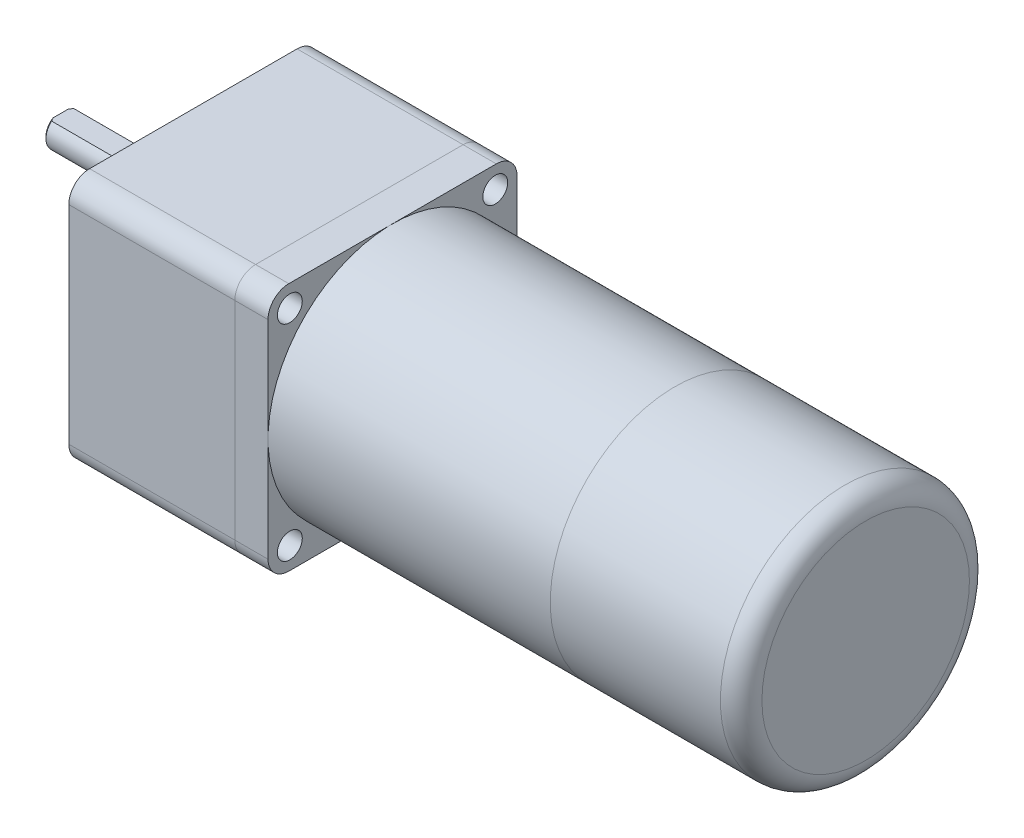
ISO-10303-21;
HEADER;
FILE_DESCRIPTION(('STEP AP214'),'2;1');
FILE_NAME('part.step','',(''),(''),'','','');
FILE_SCHEMA(('AUTOMOTIVE_DESIGN { 1 0 10303 214 1 1 1 1 }'));
ENDSEC;
DATA;
#1=APPLICATION_CONTEXT('core data for automotive mechanical design processes');
#2=APPLICATION_PROTOCOL_DEFINITION('international standard','automotive_design',2000,#1);
#3=PRODUCT_CONTEXT('',#1,'mechanical');
#4=PRODUCT('Part','Part','',(#3));
#5=PRODUCT_RELATED_PRODUCT_CATEGORY('part','',(#4));
#6=PRODUCT_DEFINITION_FORMATION('','',#4);
#7=PRODUCT_DEFINITION_CONTEXT('part definition',#1,'design');
#8=PRODUCT_DEFINITION('design','',#6,#7);
#9=PRODUCT_DEFINITION_SHAPE('','',#8);
#10=(LENGTH_UNIT() NAMED_UNIT(*) SI_UNIT(.MILLI.,.METRE.));
#11=(NAMED_UNIT(*) PLANE_ANGLE_UNIT() SI_UNIT($,.RADIAN.));
#12=(NAMED_UNIT(*) SI_UNIT($,.STERADIAN.) SOLID_ANGLE_UNIT());
#13=UNCERTAINTY_MEASURE_WITH_UNIT(LENGTH_MEASURE(1.E-05),#10,'distance_accuracy_value','');
#14=(GEOMETRIC_REPRESENTATION_CONTEXT(3) GLOBAL_UNCERTAINTY_ASSIGNED_CONTEXT((#13)) GLOBAL_UNIT_ASSIGNED_CONTEXT((#10,
#11,#12)) REPRESENTATION_CONTEXT('',''));
#15=CARTESIAN_POINT('',(0.,0.,0.));
#16=DIRECTION('',(0.,0.,1.));
#17=DIRECTION('',(1.,0.,0.));
#18=AXIS2_PLACEMENT_3D('',#15,#16,#17);
#19=CARTESIAN_POINT('',(-32.,10.,0.));
#20=DIRECTION('',(1.,0.,0.));
#21=DIRECTION('',(0.,0.,-1.));
#22=AXIS2_PLACEMENT_3D('',#19,#20,#21);
#23=CYLINDRICAL_SURFACE('',#22,4.);
#24=DIRECTION('',(-1.,0.,0.));
#25=VECTOR('',#24,1.);
#26=CARTESIAN_POINT('',(-7.,13.,2.64575131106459));
#27=LINE('',#26,#25);
#28=CARTESIAN_POINT('',(-7.,13.,2.64575131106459));
#29=VERTEX_POINT('',#28);
#30=CARTESIAN_POINT('',(-31.5,13.,2.64575131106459));
#31=VERTEX_POINT('',#30);
#32=EDGE_CURVE('E87',#29,#31,#27,.T.);
#33=ORIENTED_EDGE('',*,*,#32,.T.);
#34=CARTESIAN_POINT('',(-31.5,10.,0.));
#35=DIRECTION('',(-1.,0.,0.));
#36=DIRECTION('',(0.,0.,1.));
#37=AXIS2_PLACEMENT_3D('',#34,#35,#36);
#38=CIRCLE('',#37,4.);
#39=CARTESIAN_POINT('',(-31.5,13.,-2.64575131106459));
#40=VERTEX_POINT('',#39);
#41=EDGE_CURVE('E12',#31,#40,#38,.F.);
#42=ORIENTED_EDGE('',*,*,#41,.T.);
#43=DIRECTION('',(-1.,0.,0.));
#44=VECTOR('',#43,1.);
#45=CARTESIAN_POINT('',(-7.,13.,-2.64575131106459));
#46=LINE('',#45,#44);
#47=CARTESIAN_POINT('',(-7.,13.,-2.64575131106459));
#48=VERTEX_POINT('',#47);
#49=EDGE_CURVE('E85',#48,#40,#46,.T.);
#50=ORIENTED_EDGE('',*,*,#49,.F.);
#51=CARTESIAN_POINT('',(-7.,10.,0.));
#52=DIRECTION('',(-1.,0.,0.));
#53=DIRECTION('',(0.,0.,1.));
#54=AXIS2_PLACEMENT_3D('',#51,#52,#53);
#55=CIRCLE('',#54,4.);
#56=EDGE_CURVE('E78',#29,#48,#55,.T.);
#57=ORIENTED_EDGE('',*,*,#56,.F.);
#58=EDGE_LOOP('',(#33,#42,#50,#57));
#59=FACE_BOUND('',#58,.T.);
#60=CARTESIAN_POINT('',(-3.3,10.,0.));
#61=DIRECTION('',(-1.,0.,0.));
#62=DIRECTION('',(0.,0.,1.));
#63=AXIS2_PLACEMENT_3D('',#60,#61,#62);
#64=CIRCLE('',#63,4.);
#65=CARTESIAN_POINT('',(-3.3,10.,4.));
#66=VERTEX_POINT('',#65);
#67=EDGE_CURVE('E91',#66,#66,#64,.T.);
#68=ORIENTED_EDGE('',*,*,#67,.T.);
#69=EDGE_LOOP('',(#68));
#70=FACE_BOUND('',#69,.T.);
#71=ADVANCED_FACE('F44',(#59,#70),#23,.T.);
#72=CARTESIAN_POINT('',(-32.,10.,0.));
#73=DIRECTION('',(-1.,0.,0.));
#74=DIRECTION('',(0.,0.,1.));
#75=AXIS2_PLACEMENT_3D('',#72,#73,#74);
#76=PLANE('',#75);
#77=DIRECTION('',(0.,0.,1.));
#78=VECTOR('',#77,1.);
#79=CARTESIAN_POINT('',(-32.,13.,2.64575131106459));
#80=LINE('',#79,#78);
#81=CARTESIAN_POINT('',(-32.,13.,-1.80277563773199));
#82=VERTEX_POINT('',#81);
#83=CARTESIAN_POINT('',(-32.,13.,1.80277563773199));
#84=VERTEX_POINT('',#83);
#85=EDGE_CURVE('E82',#82,#84,#80,.T.);
#86=ORIENTED_EDGE('',*,*,#85,.F.);
#87=CARTESIAN_POINT('',(-32.,10.,0.));
#88=DIRECTION('',(-1.,0.,0.));
#89=DIRECTION('',(0.,0.,1.));
#90=AXIS2_PLACEMENT_3D('',#87,#88,#89);
#91=CIRCLE('',#90,3.5);
#92=EDGE_CURVE('E97',#82,#84,#91,.T.);
#93=ORIENTED_EDGE('',*,*,#92,.T.);
#94=EDGE_LOOP('',(#86,#93));
#95=FACE_BOUND('',#94,.T.);
#96=ADVANCED_FACE('F113',(#95),#76,.T.);
#97=CARTESIAN_POINT('',(-3.3,10.,0.));
#98=DIRECTION('',(-1.,0.,0.));
#99=DIRECTION('',(0.,0.,1.));
#100=AXIS2_PLACEMENT_3D('',#97,#98,#99);
#101=PLANE('',#100);
#102=ORIENTED_EDGE('',*,*,#67,.F.);
#103=EDGE_LOOP('',(#102));
#104=FACE_BOUND('',#103,.T.);
#105=ADVANCED_FACE('F112',(#104),#101,.F.);
#106=CARTESIAN_POINT('',(-7.,13.,2.64575131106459));
#107=DIRECTION('',(0.,-1.,0.));
#108=DIRECTION('',(0.,0.,-1.));
#109=AXIS2_PLACEMENT_3D('',#106,#107,#108);
#110=PLANE('',#109);
#111=ORIENTED_EDGE('',*,*,#85,.T.);
#112=CARTESIAN_POINT('',(-32.,13.,1.80277563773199));
#113=CARTESIAN_POINT('',(-31.962552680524,13.,1.87545495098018));
#114=CARTESIAN_POINT('',(-31.9238154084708,13.,1.94745530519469));
#115=CARTESIAN_POINT('',(-31.8441464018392,13.,2.09016482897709));
#116=CARTESIAN_POINT('',(-31.8032162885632,13.,2.16087490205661));
#117=CARTESIAN_POINT('',(-31.7194976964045,13.,2.30116567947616));
#118=CARTESIAN_POINT('',(-31.6767094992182,13.,2.37074655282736));
#119=CARTESIAN_POINT('',(-31.5895037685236,13.,2.50895192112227));
#120=CARTESIAN_POINT('',(-31.5450850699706,13.,2.57757568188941));
#121=CARTESIAN_POINT('',(-31.5,13.,2.64575131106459));
#122=B_SPLINE_CURVE_WITH_KNOTS('',3,(#112,#113,#114,#115,#116,#117,#118,#119,#120,#121),
.UNSPECIFIED.,.F.,.F.,(4,2,2,2,4),(0.,0.245246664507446,0.490314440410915,0.735345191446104,
0.980554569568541),.UNSPECIFIED.);
#123=EDGE_CURVE('E53',#84,#31,#122,.T.);
#124=ORIENTED_EDGE('',*,*,#123,.T.);
#125=ORIENTED_EDGE('',*,*,#32,.F.);
#126=DIRECTION('',(0.,0.,1.));
#127=VECTOR('',#126,1.);
#128=CARTESIAN_POINT('',(-7.,13.,2.64575131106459));
#129=LINE('',#128,#127);
#130=EDGE_CURVE('E81',#48,#29,#129,.T.);
#131=ORIENTED_EDGE('',*,*,#130,.F.);
#132=ORIENTED_EDGE('',*,*,#49,.T.);
#133=CARTESIAN_POINT('',(-31.5,13.,-2.64575131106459));
#134=CARTESIAN_POINT('',(-31.5450850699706,13.,-2.57757568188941));
#135=CARTESIAN_POINT('',(-31.5895037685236,13.,-2.50895192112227));
#136=CARTESIAN_POINT('',(-31.6767094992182,13.,-2.37074655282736));
#137=CARTESIAN_POINT('',(-31.7194976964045,13.,-2.30116567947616));
#138=CARTESIAN_POINT('',(-31.8032162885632,13.,-2.16087490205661));
#139=CARTESIAN_POINT('',(-31.8441464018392,13.,-2.09016482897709));
#140=CARTESIAN_POINT('',(-31.9238154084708,13.,-1.94745530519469));
#141=CARTESIAN_POINT('',(-31.962552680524,13.,-1.87545495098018));
#142=CARTESIAN_POINT('',(-32.,13.,-1.80277563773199));
#143=B_SPLINE_CURVE_WITH_KNOTS('',3,(#133,#134,#135,#136,#137,#138,#139,#140,#141,#142),
.UNSPECIFIED.,.F.,.F.,(4,2,2,2,4),(0.,0.245209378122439,0.490240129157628,0.735307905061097,
0.980554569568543),.UNSPECIFIED.);
#144=EDGE_CURVE('E100',#40,#82,#143,.T.);
#145=ORIENTED_EDGE('',*,*,#144,.T.);
#146=EDGE_LOOP('',(#111,#124,#125,#131,#132,#145));
#147=FACE_BOUND('',#146,.T.);
#148=ADVANCED_FACE('F84',(#147),#110,.F.);
#149=CARTESIAN_POINT('',(-7.,10.,0.));
#150=DIRECTION('',(-1.,0.,0.));
#151=DIRECTION('',(0.,0.,1.));
#152=AXIS2_PLACEMENT_3D('',#149,#150,#151);
#153=PLANE('',#152);
#154=ORIENTED_EDGE('',*,*,#56,.T.);
#155=ORIENTED_EDGE('',*,*,#130,.T.);
#156=EDGE_LOOP('',(#154,#155));
#157=FACE_BOUND('',#156,.T.);
#158=ADVANCED_FACE('F80',(#157),#153,.T.);
#159=CARTESIAN_POINT('',(-32.,10.,0.));
#160=DIRECTION('',(1.,0.,0.));
#161=DIRECTION('',(0.,0.,-1.));
#162=AXIS2_PLACEMENT_3D('',#159,#160,#161);
#163=CONICAL_SURFACE('',#162,3.5,0.785398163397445);
#164=ORIENTED_EDGE('',*,*,#144,.F.);
#165=ORIENTED_EDGE('',*,*,#41,.F.);
#166=ORIENTED_EDGE('',*,*,#123,.F.);
#167=ORIENTED_EDGE('',*,*,#92,.F.);
#168=EDGE_LOOP('',(#164,#165,#166,#167));
#169=FACE_BOUND('',#168,.T.);
#170=ADVANCED_FACE('F46',(#169),#163,.T.);
#171=CLOSED_SHELL('',(#71,#96,#105,#148,#158,#170));
#172=MANIFOLD_SOLID_BREP('B2',#171);
#173=CARTESIAN_POINT('',(-3.3,10.,0.));
#174=DIRECTION('',(1.,0.,0.));
#175=DIRECTION('',(0.,0.,-1.));
#176=AXIS2_PLACEMENT_3D('',#173,#174,#175);
#177=CYLINDRICAL_SURFACE('',#176,12.);
#178=CARTESIAN_POINT('',(-2.8,10.,0.));
#179=DIRECTION('',(-1.,0.,0.));
#180=DIRECTION('',(0.,0.,1.));
#181=AXIS2_PLACEMENT_3D('',#178,#179,#180);
#182=CIRCLE('',#181,12.);
#183=CARTESIAN_POINT('',(-2.8,10.,12.));
#184=VERTEX_POINT('',#183);
#185=EDGE_CURVE('E43',#184,#184,#182,.F.);
#186=ORIENTED_EDGE('',*,*,#185,.T.);
#187=EDGE_LOOP('',(#186));
#188=FACE_BOUND('',#187,.T.);
#189=CARTESIAN_POINT('',(0.,10.,0.));
#190=DIRECTION('',(-1.,0.,0.));
#191=DIRECTION('',(0.,0.,1.));
#192=AXIS2_PLACEMENT_3D('',#189,#190,#191);
#193=CIRCLE('',#192,12.);
#194=CARTESIAN_POINT('',(0.,10.,12.));
#195=VERTEX_POINT('',#194);
#196=EDGE_CURVE('E186',#195,#195,#193,.T.);
#197=ORIENTED_EDGE('',*,*,#196,.T.);
#198=EDGE_LOOP('',(#197));
#199=FACE_BOUND('',#198,.T.);
#200=ADVANCED_FACE('F175',(#188,#199),#177,.T.);
#201=CARTESIAN_POINT('',(-3.3,10.,0.));
#202=DIRECTION('',(-1.,0.,0.));
#203=DIRECTION('',(0.,0.,1.));
#204=AXIS2_PLACEMENT_3D('',#201,#202,#203);
#205=PLANE('',#204);
#206=CARTESIAN_POINT('',(-3.3,10.,0.));
#207=DIRECTION('',(-1.,0.,0.));
#208=DIRECTION('',(0.,0.,1.));
#209=AXIS2_PLACEMENT_3D('',#206,#207,#208);
#210=CIRCLE('',#209,11.5);
#211=CARTESIAN_POINT('',(-3.3,10.,11.5));
#212=VERTEX_POINT('',#211);
#213=EDGE_CURVE('E182',#212,#212,#210,.T.);
#214=ORIENTED_EDGE('',*,*,#213,.T.);
#215=EDGE_LOOP('',(#214));
#216=FACE_BOUND('',#215,.T.);
#217=ADVANCED_FACE('F196',(#216),#205,.T.);
#218=CARTESIAN_POINT('',(0.,10.,0.));
#219=DIRECTION('',(-1.,0.,0.));
#220=DIRECTION('',(0.,0.,1.));
#221=AXIS2_PLACEMENT_3D('',#218,#219,#220);
#222=PLANE('',#221);
#223=ORIENTED_EDGE('',*,*,#196,.F.);
#224=EDGE_LOOP('',(#223));
#225=FACE_BOUND('',#224,.T.);
#226=ADVANCED_FACE('F194',(#225),#222,.F.);
#227=CARTESIAN_POINT('',(-2.8,10.,0.));
#228=DIRECTION('',(-1.,0.,0.));
#229=DIRECTION('',(0.,0.,1.));
#230=AXIS2_PLACEMENT_3D('',#227,#228,#229);
#231=TOROIDAL_SURFACE('',#230,11.5,0.5);
#232=ORIENTED_EDGE('',*,*,#185,.F.);
#233=EDGE_LOOP('',(#232));
#234=FACE_BOUND('',#233,.T.);
#235=ORIENTED_EDGE('',*,*,#213,.F.);
#236=EDGE_LOOP('',(#235));
#237=FACE_BOUND('',#236,.T.);
#238=ADVANCED_FACE('F177',(#234,#237),#231,.T.);
#239=CLOSED_SHELL('',(#200,#217,#226,#238));
#240=MANIFOLD_SOLID_BREP('B6',#239);
#241=CARTESIAN_POINT('',(162.,0.,0.));
#242=DIRECTION('',(-1.,0.,0.));
#243=DIRECTION('',(0.,0.,1.));
#244=AXIS2_PLACEMENT_3D('',#241,#242,#243);
#245=CYLINDRICAL_SURFACE('',#244,30.);
#246=CARTESIAN_POINT('',(157.,0.,0.));
#247=DIRECTION('',(1.,0.,0.));
#248=DIRECTION('',(0.,0.,-1.));
#249=AXIS2_PLACEMENT_3D('',#246,#247,#248);
#250=CIRCLE('',#249,30.);
#251=CARTESIAN_POINT('',(157.,0.,-30.));
#252=VERTEX_POINT('',#251);
#253=EDGE_CURVE('E174',#252,#252,#250,.F.);
#254=ORIENTED_EDGE('',*,*,#253,.T.);
#255=EDGE_LOOP('',(#254));
#256=FACE_BOUND('',#255,.T.);
#257=CARTESIAN_POINT('',(116.,0.,0.));
#258=DIRECTION('',(1.,0.,0.));
#259=DIRECTION('',(0.,0.,-1.));
#260=AXIS2_PLACEMENT_3D('',#257,#258,#259);
#261=CIRCLE('',#260,30.);
#262=CARTESIAN_POINT('',(116.,0.,-30.));
#263=VERTEX_POINT('',#262);
#264=EDGE_CURVE('E250',#263,#263,#261,.T.);
#265=ORIENTED_EDGE('',*,*,#264,.T.);
#266=EDGE_LOOP('',(#265));
#267=FACE_BOUND('',#266,.T.);
#268=ADVANCED_FACE('F239',(#256,#267),#245,.T.);
#269=CARTESIAN_POINT('',(162.,0.,0.));
#270=DIRECTION('',(1.,0.,0.));
#271=DIRECTION('',(0.,0.,-1.));
#272=AXIS2_PLACEMENT_3D('',#269,#270,#271);
#273=PLANE('',#272);
#274=CARTESIAN_POINT('',(162.,0.,0.));
#275=DIRECTION('',(1.,0.,0.));
#276=DIRECTION('',(0.,0.,-1.));
#277=AXIS2_PLACEMENT_3D('',#274,#275,#276);
#278=CIRCLE('',#277,25.);
#279=CARTESIAN_POINT('',(162.,0.,-25.));
#280=VERTEX_POINT('',#279);
#281=EDGE_CURVE('E246',#280,#280,#278,.T.);
#282=ORIENTED_EDGE('',*,*,#281,.T.);
#283=EDGE_LOOP('',(#282));
#284=FACE_BOUND('',#283,.T.);
#285=ADVANCED_FACE('F260',(#284),#273,.T.);
#286=CARTESIAN_POINT('',(116.,0.,0.));
#287=DIRECTION('',(1.,0.,0.));
#288=DIRECTION('',(0.,0.,-1.));
#289=AXIS2_PLACEMENT_3D('',#286,#287,#288);
#290=PLANE('',#289);
#291=ORIENTED_EDGE('',*,*,#264,.F.);
#292=EDGE_LOOP('',(#291));
#293=FACE_BOUND('',#292,.T.);
#294=ADVANCED_FACE('F258',(#293),#290,.F.);
#295=CARTESIAN_POINT('',(157.,0.,0.));
#296=DIRECTION('',(1.,0.,0.));
#297=DIRECTION('',(0.,0.,-1.));
#298=AXIS2_PLACEMENT_3D('',#295,#296,#297);
#299=TOROIDAL_SURFACE('',#298,25.,5.);
#300=ORIENTED_EDGE('',*,*,#253,.F.);
#301=EDGE_LOOP('',(#300));
#302=FACE_BOUND('',#301,.T.);
#303=ORIENTED_EDGE('',*,*,#281,.F.);
#304=EDGE_LOOP('',(#303));
#305=FACE_BOUND('',#304,.T.);
#306=ADVANCED_FACE('F241',(#302,#305),#299,.T.);
#307=CLOSED_SHELL('',(#268,#285,#294,#306));
#308=MANIFOLD_SOLID_BREP('B38',#307);
#309=CARTESIAN_POINT('',(116.,0.,0.));
#310=DIRECTION('',(-1.,0.,0.));
#311=DIRECTION('',(0.,0.,1.));
#312=AXIS2_PLACEMENT_3D('',#309,#310,#311);
#313=CYLINDRICAL_SURFACE('',#312,30.);
#314=CARTESIAN_POINT('',(116.,0.,0.));
#315=DIRECTION('',(1.,0.,0.));
#316=DIRECTION('',(0.,0.,-1.));
#317=AXIS2_PLACEMENT_3D('',#314,#315,#316);
#318=CIRCLE('',#317,30.);
#319=CARTESIAN_POINT('',(116.,0.,-30.));
#320=VERTEX_POINT('',#319);
#321=EDGE_CURVE('E238',#320,#320,#318,.T.);
#322=ORIENTED_EDGE('',*,*,#321,.F.);
#323=EDGE_LOOP('',(#322));
#324=FACE_BOUND('',#323,.T.);
#325=CARTESIAN_POINT('',(48.,0.,0.));
#326=DIRECTION('',(1.,0.,0.));
#327=DIRECTION('',(0.,0.,-1.));
#328=AXIS2_PLACEMENT_3D('',#325,#326,#327);
#329=CIRCLE('',#328,30.);
#330=CARTESIAN_POINT('',(48.,0.,-30.));
#331=VERTEX_POINT('',#330);
#332=EDGE_CURVE('E308',#331,#331,#329,.T.);
#333=ORIENTED_EDGE('',*,*,#332,.T.);
#334=EDGE_LOOP('',(#333));
#335=FACE_BOUND('',#334,.T.);
#336=ADVANCED_FACE('F305',(#324,#335),#313,.T.);
#337=CARTESIAN_POINT('',(116.,0.,0.));
#338=DIRECTION('',(1.,0.,0.));
#339=DIRECTION('',(0.,0.,-1.));
#340=AXIS2_PLACEMENT_3D('',#337,#338,#339);
#341=PLANE('',#340);
#342=ORIENTED_EDGE('',*,*,#321,.T.);
#343=EDGE_LOOP('',(#342));
#344=FACE_BOUND('',#343,.T.);
#345=ADVANCED_FACE('F320',(#344),#341,.T.);
#346=CARTESIAN_POINT('',(48.,0.,0.));
#347=DIRECTION('',(1.,0.,0.));
#348=DIRECTION('',(0.,0.,-1.));
#349=AXIS2_PLACEMENT_3D('',#346,#347,#348);
#350=PLANE('',#349);
#351=ORIENTED_EDGE('',*,*,#332,.F.);
#352=EDGE_LOOP('',(#351));
#353=FACE_BOUND('',#352,.T.);
#354=ADVANCED_FACE('F318',(#353),#350,.F.);
#355=CLOSED_SHELL('',(#336,#345,#354));
#356=MANIFOLD_SOLID_BREP('B169',#355);
#357=CARTESIAN_POINT('',(48.,-25.,25.));
#358=DIRECTION('',(-1.,0.,0.));
#359=DIRECTION('',(0.,0.,1.));
#360=AXIS2_PLACEMENT_3D('',#357,#358,#359);
#361=CYLINDRICAL_SURFACE('',#360,5.);
#362=CARTESIAN_POINT('',(40.,-25.,25.));
#363=DIRECTION('',(1.,0.,0.));
#364=DIRECTION('',(0.,0.,1.));
#365=AXIS2_PLACEMENT_3D('',#362,#363,#364);
#366=CIRCLE('',#365,5.);
#367=CARTESIAN_POINT('',(40.,-25.,30.));
#368=VERTEX_POINT('',#367);
#369=CARTESIAN_POINT('',(40.,-30.,25.));
#370=VERTEX_POINT('',#369);
#371=EDGE_CURVE('E453',#368,#370,#366,.T.);
#372=ORIENTED_EDGE('',*,*,#371,.T.);
#373=DIRECTION('',(-1.,0.,0.));
#374=VECTOR('',#373,1.);
#375=CARTESIAN_POINT('',(48.,-30.,25.));
#376=LINE('',#375,#374);
#377=CARTESIAN_POINT('',(48.,-30.,25.));
#378=VERTEX_POINT('',#377);
#379=EDGE_CURVE('E303',#378,#370,#376,.T.);
#380=ORIENTED_EDGE('',*,*,#379,.F.);
#381=CARTESIAN_POINT('',(48.,-25.,25.));
#382=DIRECTION('',(1.,0.,0.));
#383=DIRECTION('',(0.,0.,1.));
#384=AXIS2_PLACEMENT_3D('',#381,#382,#383);
#385=CIRCLE('',#384,5.);
#386=CARTESIAN_POINT('',(48.,-25.,30.));
#387=VERTEX_POINT('',#386);
#388=EDGE_CURVE('E467',#387,#378,#385,.T.);
#389=ORIENTED_EDGE('',*,*,#388,.F.);
#390=DIRECTION('',(-1.,0.,0.));
#391=VECTOR('',#390,1.);
#392=CARTESIAN_POINT('',(48.,-25.,30.));
#393=LINE('',#392,#391);
#394=EDGE_CURVE('E449',#387,#368,#393,.T.);
#395=ORIENTED_EDGE('',*,*,#394,.T.);
#396=EDGE_LOOP('',(#372,#380,#389,#395));
#397=FACE_BOUND('',#396,.T.);
#398=ADVANCED_FACE('F355',(#397),#361,.T.);
#399=CARTESIAN_POINT('',(48.,-30.,25.));
#400=DIRECTION('',(0.,1.,0.));
#401=DIRECTION('',(0.,0.,1.));
#402=AXIS2_PLACEMENT_3D('',#399,#400,#401);
#403=PLANE('',#402);
#404=DIRECTION('',(0.,0.,-1.));
#405=VECTOR('',#404,1.);
#406=CARTESIAN_POINT('',(40.,-30.,25.));
#407=LINE('',#406,#405);
#408=CARTESIAN_POINT('',(40.,-30.,-25.));
#409=VERTEX_POINT('',#408);
#410=EDGE_CURVE('E456',#370,#409,#407,.T.);
#411=ORIENTED_EDGE('',*,*,#410,.T.);
#412=DIRECTION('',(-1.,0.,0.));
#413=VECTOR('',#412,1.);
#414=CARTESIAN_POINT('',(48.,-30.,-25.));
#415=LINE('',#414,#413);
#416=CARTESIAN_POINT('',(48.,-30.,-25.));
#417=VERTEX_POINT('',#416);
#418=EDGE_CURVE('E364',#417,#409,#415,.T.);
#419=ORIENTED_EDGE('',*,*,#418,.F.);
#420=DIRECTION('',(0.,0.,-1.));
#421=VECTOR('',#420,1.);
#422=CARTESIAN_POINT('',(48.,-30.,25.));
#423=LINE('',#422,#421);
#424=EDGE_CURVE('E416',#378,#417,#423,.T.);
#425=ORIENTED_EDGE('',*,*,#424,.F.);
#426=ORIENTED_EDGE('',*,*,#379,.T.);
#427=EDGE_LOOP('',(#411,#419,#425,#426));
#428=FACE_BOUND('',#427,.T.);
#429=ADVANCED_FACE('F521',(#428),#403,.F.);
#430=CARTESIAN_POINT('',(48.,-25.,-25.));
#431=DIRECTION('',(-1.,0.,0.));
#432=DIRECTION('',(0.,0.,1.));
#433=AXIS2_PLACEMENT_3D('',#430,#431,#432);
#434=CYLINDRICAL_SURFACE('',#433,5.);
#435=CARTESIAN_POINT('',(40.,-25.,-25.));
#436=DIRECTION('',(1.,0.,0.));
#437=DIRECTION('',(0.,0.,-1.));
#438=AXIS2_PLACEMENT_3D('',#435,#436,#437);
#439=CIRCLE('',#438,5.);
#440=CARTESIAN_POINT('',(40.,-25.,-30.));
#441=VERTEX_POINT('',#440);
#442=EDGE_CURVE('E458',#409,#441,#439,.T.);
#443=ORIENTED_EDGE('',*,*,#442,.T.);
#444=DIRECTION('',(-1.,0.,0.));
#445=VECTOR('',#444,1.);
#446=CARTESIAN_POINT('',(48.,-25.,-30.));
#447=LINE('',#446,#445);
#448=CARTESIAN_POINT('',(48.,-25.,-30.));
#449=VERTEX_POINT('',#448);
#450=EDGE_CURVE('E474',#449,#441,#447,.T.);
#451=ORIENTED_EDGE('',*,*,#450,.F.);
#452=CARTESIAN_POINT('',(48.,-25.,-25.));
#453=DIRECTION('',(1.,0.,0.));
#454=DIRECTION('',(0.,0.,-1.));
#455=AXIS2_PLACEMENT_3D('',#452,#453,#454);
#456=CIRCLE('',#455,5.);
#457=EDGE_CURVE('E622',#417,#449,#456,.T.);
#458=ORIENTED_EDGE('',*,*,#457,.F.);
#459=ORIENTED_EDGE('',*,*,#418,.T.);
#460=EDGE_LOOP('',(#443,#451,#458,#459));
#461=FACE_BOUND('',#460,.T.);
#462=ADVANCED_FACE('F525',(#461),#434,.T.);
#463=CARTESIAN_POINT('',(48.,-25.,-30.));
#464=DIRECTION('',(0.,0.,1.));
#465=DIRECTION('',(1.,0.,0.));
#466=AXIS2_PLACEMENT_3D('',#463,#464,#465);
#467=PLANE('',#466);
#468=DIRECTION('',(0.,1.,0.));
#469=VECTOR('',#468,1.);
#470=CARTESIAN_POINT('',(40.,-25.,-30.));
#471=LINE('',#470,#469);
#472=CARTESIAN_POINT('',(40.,25.,-30.));
#473=VERTEX_POINT('',#472);
#474=EDGE_CURVE('E460',#441,#473,#471,.T.);
#475=ORIENTED_EDGE('',*,*,#474,.T.);
#476=DIRECTION('',(-1.,0.,0.));
#477=VECTOR('',#476,1.);
#478=CARTESIAN_POINT('',(48.,25.,-30.));
#479=LINE('',#478,#477);
#480=CARTESIAN_POINT('',(48.,25.,-30.));
#481=VERTEX_POINT('',#480);
#482=EDGE_CURVE('E471',#481,#473,#479,.T.);
#483=ORIENTED_EDGE('',*,*,#482,.F.);
#484=DIRECTION('',(0.,1.,0.));
#485=VECTOR('',#484,1.);
#486=CARTESIAN_POINT('',(48.,-25.,-30.));
#487=LINE('',#486,#485);
#488=EDGE_CURVE('E624',#449,#481,#487,.T.);
#489=ORIENTED_EDGE('',*,*,#488,.F.);
#490=ORIENTED_EDGE('',*,*,#450,.T.);
#491=EDGE_LOOP('',(#475,#483,#489,#490));
#492=FACE_BOUND('',#491,.T.);
#493=ADVANCED_FACE('F529',(#492),#467,.F.);
#494=CARTESIAN_POINT('',(48.,25.,-25.));
#495=DIRECTION('',(-1.,0.,0.));
#496=DIRECTION('',(0.,0.,1.));
#497=AXIS2_PLACEMENT_3D('',#494,#495,#496);
#498=CYLINDRICAL_SURFACE('',#497,5.);
#499=CARTESIAN_POINT('',(40.,25.,-25.));
#500=DIRECTION('',(1.,0.,0.));
#501=DIRECTION('',(0.,0.,1.));
#502=AXIS2_PLACEMENT_3D('',#499,#500,#501);
#503=CIRCLE('',#502,5.);
#504=CARTESIAN_POINT('',(40.,30.,-25.));
#505=VERTEX_POINT('',#504);
#506=EDGE_CURVE('E462',#473,#505,#503,.T.);
#507=ORIENTED_EDGE('',*,*,#506,.T.);
#508=DIRECTION('',(-1.,0.,0.));
#509=VECTOR('',#508,1.);
#510=CARTESIAN_POINT('',(48.,30.,-25.));
#511=LINE('',#510,#509);
#512=CARTESIAN_POINT('',(48.,30.,-25.));
#513=VERTEX_POINT('',#512);
#514=EDGE_CURVE('E444',#513,#505,#511,.T.);
#515=ORIENTED_EDGE('',*,*,#514,.F.);
#516=CARTESIAN_POINT('',(48.,25.,-25.));
#517=DIRECTION('',(1.,0.,0.));
#518=DIRECTION('',(0.,0.,1.));
#519=AXIS2_PLACEMENT_3D('',#516,#517,#518);
#520=CIRCLE('',#519,5.);
#521=EDGE_CURVE('E435',#481,#513,#520,.T.);
#522=ORIENTED_EDGE('',*,*,#521,.F.);
#523=ORIENTED_EDGE('',*,*,#482,.T.);
#524=EDGE_LOOP('',(#507,#515,#522,#523));
#525=FACE_BOUND('',#524,.T.);
#526=ADVANCED_FACE('F535',(#525),#498,.T.);
#527=CARTESIAN_POINT('',(48.,30.,25.));
#528=DIRECTION('',(0.,-1.,0.));
#529=DIRECTION('',(0.,0.,-1.));
#530=AXIS2_PLACEMENT_3D('',#527,#528,#529);
#531=PLANE('',#530);
#532=DIRECTION('',(0.,0.,1.));
#533=VECTOR('',#532,1.);
#534=CARTESIAN_POINT('',(40.,30.,25.));
#535=LINE('',#534,#533);
#536=CARTESIAN_POINT('',(40.,30.,25.));
#537=VERTEX_POINT('',#536);
#538=EDGE_CURVE('E443',#505,#537,#535,.T.);
#539=ORIENTED_EDGE('',*,*,#538,.T.);
#540=DIRECTION('',(-1.,0.,0.));
#541=VECTOR('',#540,1.);
#542=CARTESIAN_POINT('',(48.,30.,25.));
#543=LINE('',#542,#541);
#544=CARTESIAN_POINT('',(48.,30.,25.));
#545=VERTEX_POINT('',#544);
#546=EDGE_CURVE('E440',#545,#537,#543,.T.);
#547=ORIENTED_EDGE('',*,*,#546,.F.);
#548=DIRECTION('',(0.,0.,1.));
#549=VECTOR('',#548,1.);
#550=CARTESIAN_POINT('',(48.,30.,25.));
#551=LINE('',#550,#549);
#552=EDGE_CURVE('E429',#513,#545,#551,.T.);
#553=ORIENTED_EDGE('',*,*,#552,.F.);
#554=ORIENTED_EDGE('',*,*,#514,.T.);
#555=EDGE_LOOP('',(#539,#547,#553,#554));
#556=FACE_BOUND('',#555,.T.);
#557=ADVANCED_FACE('F441',(#556),#531,.F.);
#558=CARTESIAN_POINT('',(48.,25.,25.));
#559=DIRECTION('',(-1.,0.,0.));
#560=DIRECTION('',(0.,0.,1.));
#561=AXIS2_PLACEMENT_3D('',#558,#559,#560);
#562=CYLINDRICAL_SURFACE('',#561,5.);
#563=CARTESIAN_POINT('',(40.,25.,25.));
#564=DIRECTION('',(1.,0.,0.));
#565=DIRECTION('',(0.,0.,1.));
#566=AXIS2_PLACEMENT_3D('',#563,#564,#565);
#567=CIRCLE('',#566,5.);
#568=CARTESIAN_POINT('',(40.,25.,30.));
#569=VERTEX_POINT('',#568);
#570=EDGE_CURVE('E402',#537,#569,#567,.T.);
#571=ORIENTED_EDGE('',*,*,#570,.T.);
#572=DIRECTION('',(-1.,0.,0.));
#573=VECTOR('',#572,1.);
#574=CARTESIAN_POINT('',(48.,25.,30.));
#575=LINE('',#574,#573);
#576=CARTESIAN_POINT('',(48.,25.,30.));
#577=VERTEX_POINT('',#576);
#578=EDGE_CURVE('E445',#577,#569,#575,.T.);
#579=ORIENTED_EDGE('',*,*,#578,.F.);
#580=CARTESIAN_POINT('',(48.,25.,25.));
#581=DIRECTION('',(1.,0.,0.));
#582=DIRECTION('',(0.,0.,1.));
#583=AXIS2_PLACEMENT_3D('',#580,#581,#582);
#584=CIRCLE('',#583,5.);
#585=EDGE_CURVE('E433',#545,#577,#584,.T.);
#586=ORIENTED_EDGE('',*,*,#585,.F.);
#587=ORIENTED_EDGE('',*,*,#546,.T.);
#588=EDGE_LOOP('',(#571,#579,#586,#587));
#589=FACE_BOUND('',#588,.T.);
#590=ADVANCED_FACE('F447',(#589),#562,.T.);
#591=CARTESIAN_POINT('',(48.,-25.,30.));
#592=DIRECTION('',(0.,0.,-1.));
#593=DIRECTION('',(-1.,0.,0.));
#594=AXIS2_PLACEMENT_3D('',#591,#592,#593);
#595=PLANE('',#594);
#596=DIRECTION('',(0.,-1.,0.));
#597=VECTOR('',#596,1.);
#598=CARTESIAN_POINT('',(40.,-25.,30.));
#599=LINE('',#598,#597);
#600=EDGE_CURVE('E408',#569,#368,#599,.T.);
#601=ORIENTED_EDGE('',*,*,#600,.T.);
#602=ORIENTED_EDGE('',*,*,#394,.F.);
#603=DIRECTION('',(0.,-1.,0.));
#604=VECTOR('',#603,1.);
#605=CARTESIAN_POINT('',(48.,-25.,30.));
#606=LINE('',#605,#604);
#607=EDGE_CURVE('E373',#577,#387,#606,.T.);
#608=ORIENTED_EDGE('',*,*,#607,.F.);
#609=ORIENTED_EDGE('',*,*,#578,.T.);
#610=EDGE_LOOP('',(#601,#602,#608,#609));
#611=FACE_BOUND('',#610,.T.);
#612=ADVANCED_FACE('F510',(#611),#595,.F.);
#613=CARTESIAN_POINT('',(48.,-25.,25.));
#614=DIRECTION('',(-1.,0.,0.));
#615=DIRECTION('',(0.,0.,1.));
#616=AXIS2_PLACEMENT_3D('',#613,#614,#615);
#617=PLANE('',#616);
#618=CARTESIAN_POINT('',(48.,24.7487373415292,24.7487373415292));
#619=DIRECTION('',(1.,0.,0.));
#620=DIRECTION('',(0.,0.,-1.));
#621=AXIS2_PLACEMENT_3D('',#618,#619,#620);
#622=CIRCLE('',#621,3.);
#623=CARTESIAN_POINT('',(48.,24.7487373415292,21.7487373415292));
#624=VERTEX_POINT('',#623);
#625=EDGE_CURVE('E483',#624,#624,#622,.T.);
#626=ORIENTED_EDGE('',*,*,#625,.F.);
#627=EDGE_LOOP('',(#626));
#628=FACE_BOUND('',#627,.T.);
#629=CARTESIAN_POINT('',(48.,24.7487373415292,-24.7487373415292));
#630=DIRECTION('',(1.,0.,0.));
#631=DIRECTION('',(0.,0.,-1.));
#632=AXIS2_PLACEMENT_3D('',#629,#630,#631);
#633=CIRCLE('',#632,3.);
#634=CARTESIAN_POINT('',(48.,24.7487373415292,-27.7487373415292));
#635=VERTEX_POINT('',#634);
#636=EDGE_CURVE('E608',#635,#635,#633,.T.);
#637=ORIENTED_EDGE('',*,*,#636,.F.);
#638=EDGE_LOOP('',(#637));
#639=FACE_BOUND('',#638,.T.);
#640=CARTESIAN_POINT('',(48.,-24.7487373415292,-24.7487373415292));
#641=DIRECTION('',(1.,0.,0.));
#642=DIRECTION('',(0.,0.,-1.));
#643=AXIS2_PLACEMENT_3D('',#640,#641,#642);
#644=CIRCLE('',#643,3.);
#645=CARTESIAN_POINT('',(48.,-24.7487373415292,-27.7487373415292));
#646=VERTEX_POINT('',#645);
#647=EDGE_CURVE('E610',#646,#646,#644,.T.);
#648=ORIENTED_EDGE('',*,*,#647,.F.);
#649=EDGE_LOOP('',(#648));
#650=FACE_BOUND('',#649,.T.);
#651=CARTESIAN_POINT('',(48.,-24.7487373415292,24.7487373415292));
#652=DIRECTION('',(1.,0.,0.));
#653=DIRECTION('',(0.,0.,-1.));
#654=AXIS2_PLACEMENT_3D('',#651,#652,#653);
#655=CIRCLE('',#654,3.);
#656=CARTESIAN_POINT('',(48.,-24.7487373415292,21.7487373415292));
#657=VERTEX_POINT('',#656);
#658=EDGE_CURVE('E615',#657,#657,#655,.T.);
#659=ORIENTED_EDGE('',*,*,#658,.F.);
#660=EDGE_LOOP('',(#659));
#661=FACE_BOUND('',#660,.T.);
#662=ORIENTED_EDGE('',*,*,#388,.T.);
#663=ORIENTED_EDGE('',*,*,#424,.T.);
#664=ORIENTED_EDGE('',*,*,#457,.T.);
#665=ORIENTED_EDGE('',*,*,#488,.T.);
#666=ORIENTED_EDGE('',*,*,#521,.T.);
#667=ORIENTED_EDGE('',*,*,#552,.T.);
#668=ORIENTED_EDGE('',*,*,#585,.T.);
#669=ORIENTED_EDGE('',*,*,#607,.T.);
#670=EDGE_LOOP('',(#662,#663,#664,#665,#666,#667,#668,#669));
#671=FACE_BOUND('',#670,.T.);
#672=ADVANCED_FACE('F431',(#628,#639,#650,#661,#671),#617,.F.);
#673=CARTESIAN_POINT('',(40.,-25.,25.));
#674=DIRECTION('',(-1.,0.,0.));
#675=DIRECTION('',(0.,0.,1.));
#676=AXIS2_PLACEMENT_3D('',#673,#674,#675);
#677=PLANE('',#676);
#678=CARTESIAN_POINT('',(40.,24.7487373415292,24.7487373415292));
#679=DIRECTION('',(-1.,0.,0.));
#680=DIRECTION('',(0.,0.,1.));
#681=AXIS2_PLACEMENT_3D('',#678,#679,#680);
#682=CIRCLE('',#681,3.);
#683=CARTESIAN_POINT('',(40.,24.7487373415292,27.7487373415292));
#684=VERTEX_POINT('',#683);
#685=EDGE_CURVE('E358',#684,#684,#682,.T.);
#686=ORIENTED_EDGE('',*,*,#685,.F.);
#687=EDGE_LOOP('',(#686));
#688=FACE_BOUND('',#687,.T.);
#689=CARTESIAN_POINT('',(40.,24.7487373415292,-24.7487373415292));
#690=DIRECTION('',(-1.,0.,0.));
#691=DIRECTION('',(0.,0.,1.));
#692=AXIS2_PLACEMENT_3D('',#689,#690,#691);
#693=CIRCLE('',#692,3.);
#694=CARTESIAN_POINT('',(40.,24.7487373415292,-21.7487373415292));
#695=VERTEX_POINT('',#694);
#696=EDGE_CURVE('E485',#695,#695,#693,.T.);
#697=ORIENTED_EDGE('',*,*,#696,.F.);
#698=EDGE_LOOP('',(#697));
#699=FACE_BOUND('',#698,.T.);
#700=CARTESIAN_POINT('',(40.,-24.7487373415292,-24.7487373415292));
#701=DIRECTION('',(-1.,0.,0.));
#702=DIRECTION('',(0.,0.,1.));
#703=AXIS2_PLACEMENT_3D('',#700,#701,#702);
#704=CIRCLE('',#703,3.);
#705=CARTESIAN_POINT('',(40.,-24.7487373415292,-21.7487373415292));
#706=VERTEX_POINT('',#705);
#707=EDGE_CURVE('E482',#706,#706,#704,.T.);
#708=ORIENTED_EDGE('',*,*,#707,.F.);
#709=EDGE_LOOP('',(#708));
#710=FACE_BOUND('',#709,.T.);
#711=CARTESIAN_POINT('',(40.,-24.7487373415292,24.7487373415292));
#712=DIRECTION('',(-1.,0.,0.));
#713=DIRECTION('',(0.,0.,1.));
#714=AXIS2_PLACEMENT_3D('',#711,#712,#713);
#715=CIRCLE('',#714,3.);
#716=CARTESIAN_POINT('',(40.,-24.7487373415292,27.7487373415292));
#717=VERTEX_POINT('',#716);
#718=EDGE_CURVE('E479',#717,#717,#715,.T.);
#719=ORIENTED_EDGE('',*,*,#718,.F.);
#720=EDGE_LOOP('',(#719));
#721=FACE_BOUND('',#720,.T.);
#722=ORIENTED_EDGE('',*,*,#371,.F.);
#723=ORIENTED_EDGE('',*,*,#600,.F.);
#724=ORIENTED_EDGE('',*,*,#570,.F.);
#725=ORIENTED_EDGE('',*,*,#538,.F.);
#726=ORIENTED_EDGE('',*,*,#506,.F.);
#727=ORIENTED_EDGE('',*,*,#474,.F.);
#728=ORIENTED_EDGE('',*,*,#442,.F.);
#729=ORIENTED_EDGE('',*,*,#410,.F.);
#730=EDGE_LOOP('',(#722,#723,#724,#725,#726,#727,#728,#729));
#731=FACE_BOUND('',#730,.T.);
#732=ADVANCED_FACE('F495',(#688,#699,#710,#721,#731),#677,.T.);
#733=CARTESIAN_POINT('',(11.5,-24.7487373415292,24.7487373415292));
#734=DIRECTION('',(1.,0.,0.));
#735=DIRECTION('',(0.,0.,-1.));
#736=AXIS2_PLACEMENT_3D('',#733,#734,#735);
#737=CYLINDRICAL_SURFACE('',#736,3.);
#738=ORIENTED_EDGE('',*,*,#718,.T.);
#739=EDGE_LOOP('',(#738));
#740=FACE_BOUND('',#739,.T.);
#741=ORIENTED_EDGE('',*,*,#658,.T.);
#742=EDGE_LOOP('',(#741));
#743=FACE_BOUND('',#742,.T.);
#744=ADVANCED_FACE('F498',(#740,#743),#737,.F.);
#745=CARTESIAN_POINT('',(11.5,-24.7487373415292,-24.7487373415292));
#746=DIRECTION('',(1.,0.,0.));
#747=DIRECTION('',(0.,0.,-1.));
#748=AXIS2_PLACEMENT_3D('',#745,#746,#747);
#749=CYLINDRICAL_SURFACE('',#748,3.);
#750=ORIENTED_EDGE('',*,*,#707,.T.);
#751=EDGE_LOOP('',(#750));
#752=FACE_BOUND('',#751,.T.);
#753=ORIENTED_EDGE('',*,*,#647,.T.);
#754=EDGE_LOOP('',(#753));
#755=FACE_BOUND('',#754,.T.);
#756=ADVANCED_FACE('F574',(#752,#755),#749,.F.);
#757=CARTESIAN_POINT('',(11.5,24.7487373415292,-24.7487373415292));
#758=DIRECTION('',(1.,0.,0.));
#759=DIRECTION('',(0.,0.,-1.));
#760=AXIS2_PLACEMENT_3D('',#757,#758,#759);
#761=CYLINDRICAL_SURFACE('',#760,3.);
#762=ORIENTED_EDGE('',*,*,#696,.T.);
#763=EDGE_LOOP('',(#762));
#764=FACE_BOUND('',#763,.T.);
#765=ORIENTED_EDGE('',*,*,#636,.T.);
#766=EDGE_LOOP('',(#765));
#767=FACE_BOUND('',#766,.T.);
#768=ADVANCED_FACE('F584',(#764,#767),#761,.F.);
#769=CARTESIAN_POINT('',(11.5,24.7487373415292,24.7487373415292));
#770=DIRECTION('',(1.,0.,0.));
#771=DIRECTION('',(0.,0.,-1.));
#772=AXIS2_PLACEMENT_3D('',#769,#770,#771);
#773=CYLINDRICAL_SURFACE('',#772,3.);
#774=ORIENTED_EDGE('',*,*,#685,.T.);
#775=EDGE_LOOP('',(#774));
#776=FACE_BOUND('',#775,.T.);
#777=ORIENTED_EDGE('',*,*,#625,.T.);
#778=EDGE_LOOP('',(#777));
#779=FACE_BOUND('',#778,.T.);
#780=ADVANCED_FACE('F492',(#776,#779),#773,.F.);
#781=CLOSED_SHELL('',(#398,#429,#462,#493,#526,#557,#590,#612,#672,#732,#744,#756,#768,#780));
#782=MANIFOLD_SOLID_BREP('B233',#781);
#783=CARTESIAN_POINT('',(40.,-25.,25.));
#784=DIRECTION('',(-1.,0.,0.));
#785=DIRECTION('',(0.,0.,1.));
#786=AXIS2_PLACEMENT_3D('',#783,#784,#785);
#787=CYLINDRICAL_SURFACE('',#786,5.);
#788=CARTESIAN_POINT('',(0.,-25.,25.));
#789=DIRECTION('',(1.,0.,0.));
#790=DIRECTION('',(0.,0.,1.));
#791=AXIS2_PLACEMENT_3D('',#788,#789,#790);
#792=CIRCLE('',#791,5.);
#793=CARTESIAN_POINT('',(0.,-25.,30.));
#794=VERTEX_POINT('',#793);
#795=CARTESIAN_POINT('',(0.,-30.,25.));
#796=VERTEX_POINT('',#795);
#797=EDGE_CURVE('E765',#794,#796,#792,.T.);
#798=ORIENTED_EDGE('',*,*,#797,.T.);
#799=DIRECTION('',(-1.,0.,0.));
#800=VECTOR('',#799,1.);
#801=CARTESIAN_POINT('',(40.,-30.,25.));
#802=LINE('',#801,#800);
#803=CARTESIAN_POINT('',(40.,-30.,25.));
#804=VERTEX_POINT('',#803);
#805=EDGE_CURVE('E793',#804,#796,#802,.T.);
#806=ORIENTED_EDGE('',*,*,#805,.F.);
#807=CARTESIAN_POINT('',(40.,-25.,25.));
#808=DIRECTION('',(1.,0.,0.));
#809=DIRECTION('',(0.,0.,1.));
#810=AXIS2_PLACEMENT_3D('',#807,#808,#809);
#811=CIRCLE('',#810,5.);
#812=CARTESIAN_POINT('',(40.,-25.,30.));
#813=VERTEX_POINT('',#812);
#814=EDGE_CURVE('E780',#813,#804,#811,.T.);
#815=ORIENTED_EDGE('',*,*,#814,.F.);
#816=DIRECTION('',(-1.,0.,0.));
#817=VECTOR('',#816,1.);
#818=CARTESIAN_POINT('',(40.,-25.,30.));
#819=LINE('',#818,#817);
#820=EDGE_CURVE('E761',#813,#794,#819,.T.);
#821=ORIENTED_EDGE('',*,*,#820,.T.);
#822=EDGE_LOOP('',(#798,#806,#815,#821));
#823=FACE_BOUND('',#822,.T.);
#824=ADVANCED_FACE('F667',(#823),#787,.T.);
#825=CARTESIAN_POINT('',(40.,-30.,25.));
#826=DIRECTION('',(0.,1.,0.));
#827=DIRECTION('',(0.,0.,1.));
#828=AXIS2_PLACEMENT_3D('',#825,#826,#827);
#829=PLANE('',#828);
#830=DIRECTION('',(0.,0.,-1.));
#831=VECTOR('',#830,1.);
#832=CARTESIAN_POINT('',(0.,-30.,25.));
#833=LINE('',#832,#831);
#834=CARTESIAN_POINT('',(0.,-30.,-25.));
#835=VERTEX_POINT('',#834);
#836=EDGE_CURVE('E768',#796,#835,#833,.T.);
#837=ORIENTED_EDGE('',*,*,#836,.T.);
#838=DIRECTION('',(-1.,0.,0.));
#839=VECTOR('',#838,1.);
#840=CARTESIAN_POINT('',(40.,-30.,-25.));
#841=LINE('',#840,#839);
#842=CARTESIAN_POINT('',(40.,-30.,-25.));
#843=VERTEX_POINT('',#842);
#844=EDGE_CURVE('E790',#843,#835,#841,.T.);
#845=ORIENTED_EDGE('',*,*,#844,.F.);
#846=DIRECTION('',(0.,0.,-1.));
#847=VECTOR('',#846,1.);
#848=CARTESIAN_POINT('',(40.,-30.,25.));
#849=LINE('',#848,#847);
#850=EDGE_CURVE('E728',#804,#843,#849,.T.);
#851=ORIENTED_EDGE('',*,*,#850,.F.);
#852=ORIENTED_EDGE('',*,*,#805,.T.);
#853=EDGE_LOOP('',(#837,#845,#851,#852));
#854=FACE_BOUND('',#853,.T.);
#855=ADVANCED_FACE('F849',(#854),#829,.F.);
#856=CARTESIAN_POINT('',(40.,-25.,-25.));
#857=DIRECTION('',(-1.,0.,0.));
#858=DIRECTION('',(0.,0.,1.));
#859=AXIS2_PLACEMENT_3D('',#856,#857,#858);
#860=CYLINDRICAL_SURFACE('',#859,5.);
#861=CARTESIAN_POINT('',(0.,-25.,-25.));
#862=DIRECTION('',(1.,0.,0.));
#863=DIRECTION('',(0.,0.,-1.));
#864=AXIS2_PLACEMENT_3D('',#861,#862,#863);
#865=CIRCLE('',#864,5.);
#866=CARTESIAN_POINT('',(0.,-25.,-30.));
#867=VERTEX_POINT('',#866);
#868=EDGE_CURVE('E771',#835,#867,#865,.T.);
#869=ORIENTED_EDGE('',*,*,#868,.T.);
#870=DIRECTION('',(-1.,0.,0.));
#871=VECTOR('',#870,1.);
#872=CARTESIAN_POINT('',(40.,-25.,-30.));
#873=LINE('',#872,#871);
#874=CARTESIAN_POINT('',(40.,-25.,-30.));
#875=VERTEX_POINT('',#874);
#876=EDGE_CURVE('E787',#875,#867,#873,.T.);
#877=ORIENTED_EDGE('',*,*,#876,.F.);
#878=CARTESIAN_POINT('',(40.,-25.,-25.));
#879=DIRECTION('',(1.,0.,0.));
#880=DIRECTION('',(0.,0.,-1.));
#881=AXIS2_PLACEMENT_3D('',#878,#879,#880);
#882=CIRCLE('',#881,5.);
#883=EDGE_CURVE('E893',#843,#875,#882,.T.);
#884=ORIENTED_EDGE('',*,*,#883,.F.);
#885=ORIENTED_EDGE('',*,*,#844,.T.);
#886=EDGE_LOOP('',(#869,#877,#884,#885));
#887=FACE_BOUND('',#886,.T.);
#888=ADVANCED_FACE('F855',(#887),#860,.T.);
#889=CARTESIAN_POINT('',(40.,-25.,-30.));
#890=DIRECTION('',(0.,0.,1.));
#891=DIRECTION('',(1.,0.,0.));
#892=AXIS2_PLACEMENT_3D('',#889,#890,#891);
#893=PLANE('',#892);
#894=DIRECTION('',(0.,1.,0.));
#895=VECTOR('',#894,1.);
#896=CARTESIAN_POINT('',(0.,-25.,-30.));
#897=LINE('',#896,#895);
#898=CARTESIAN_POINT('',(0.,25.,-30.));
#899=VERTEX_POINT('',#898);
#900=EDGE_CURVE('E773',#867,#899,#897,.T.);
#901=ORIENTED_EDGE('',*,*,#900,.T.);
#902=DIRECTION('',(-1.,0.,0.));
#903=VECTOR('',#902,1.);
#904=CARTESIAN_POINT('',(40.,25.,-30.));
#905=LINE('',#904,#903);
#906=CARTESIAN_POINT('',(40.,25.,-30.));
#907=VERTEX_POINT('',#906);
#908=EDGE_CURVE('E784',#907,#899,#905,.T.);
#909=ORIENTED_EDGE('',*,*,#908,.F.);
#910=DIRECTION('',(0.,1.,0.));
#911=VECTOR('',#910,1.);
#912=CARTESIAN_POINT('',(40.,-25.,-30.));
#913=LINE('',#912,#911);
#914=EDGE_CURVE('E895',#875,#907,#913,.T.);
#915=ORIENTED_EDGE('',*,*,#914,.F.);
#916=ORIENTED_EDGE('',*,*,#876,.T.);
#917=EDGE_LOOP('',(#901,#909,#915,#916));
#918=FACE_BOUND('',#917,.T.);
#919=ADVANCED_FACE('F901',(#918),#893,.F.);
#920=CARTESIAN_POINT('',(40.,25.,-25.));
#921=DIRECTION('',(-1.,0.,0.));
#922=DIRECTION('',(0.,0.,1.));
#923=AXIS2_PLACEMENT_3D('',#920,#921,#922);
#924=CYLINDRICAL_SURFACE('',#923,5.);
#925=CARTESIAN_POINT('',(0.,25.,-25.));
#926=DIRECTION('',(1.,0.,0.));
#927=DIRECTION('',(0.,0.,1.));
#928=AXIS2_PLACEMENT_3D('',#925,#926,#927);
#929=CIRCLE('',#928,5.);
#930=CARTESIAN_POINT('',(0.,30.,-25.));
#931=VERTEX_POINT('',#930);
#932=EDGE_CURVE('E775',#899,#931,#929,.T.);
#933=ORIENTED_EDGE('',*,*,#932,.T.);
#934=DIRECTION('',(-1.,0.,0.));
#935=VECTOR('',#934,1.);
#936=CARTESIAN_POINT('',(40.,30.,-25.));
#937=LINE('',#936,#935);
#938=CARTESIAN_POINT('',(40.,30.,-25.));
#939=VERTEX_POINT('',#938);
#940=EDGE_CURVE('E756',#939,#931,#937,.T.);
#941=ORIENTED_EDGE('',*,*,#940,.F.);
#942=CARTESIAN_POINT('',(40.,25.,-25.));
#943=DIRECTION('',(1.,0.,0.));
#944=DIRECTION('',(0.,0.,1.));
#945=AXIS2_PLACEMENT_3D('',#942,#943,#944);
#946=CIRCLE('',#945,5.);
#947=EDGE_CURVE('E747',#907,#939,#946,.T.);
#948=ORIENTED_EDGE('',*,*,#947,.F.);
#949=ORIENTED_EDGE('',*,*,#908,.T.);
#950=EDGE_LOOP('',(#933,#941,#948,#949));
#951=FACE_BOUND('',#950,.T.);
#952=ADVANCED_FACE('F905',(#951),#924,.T.);
#953=CARTESIAN_POINT('',(40.,30.,25.));
#954=DIRECTION('',(0.,-1.,0.));
#955=DIRECTION('',(0.,0.,-1.));
#956=AXIS2_PLACEMENT_3D('',#953,#954,#955);
#957=PLANE('',#956);
#958=DIRECTION('',(0.,0.,1.));
#959=VECTOR('',#958,1.);
#960=CARTESIAN_POINT('',(0.,30.,25.));
#961=LINE('',#960,#959);
#962=CARTESIAN_POINT('',(0.,30.,25.));
#963=VERTEX_POINT('',#962);
#964=EDGE_CURVE('E755',#931,#963,#961,.T.);
#965=ORIENTED_EDGE('',*,*,#964,.T.);
#966=DIRECTION('',(-1.,0.,0.));
#967=VECTOR('',#966,1.);
#968=CARTESIAN_POINT('',(40.,30.,25.));
#969=LINE('',#968,#967);
#970=CARTESIAN_POINT('',(40.,30.,25.));
#971=VERTEX_POINT('',#970);
#972=EDGE_CURVE('E752',#971,#963,#969,.T.);
#973=ORIENTED_EDGE('',*,*,#972,.F.);
#974=DIRECTION('',(0.,0.,1.));
#975=VECTOR('',#974,1.);
#976=CARTESIAN_POINT('',(40.,30.,25.));
#977=LINE('',#976,#975);
#978=EDGE_CURVE('E741',#939,#971,#977,.T.);
#979=ORIENTED_EDGE('',*,*,#978,.F.);
#980=ORIENTED_EDGE('',*,*,#940,.T.);
#981=EDGE_LOOP('',(#965,#973,#979,#980));
#982=FACE_BOUND('',#981,.T.);
#983=ADVANCED_FACE('F753',(#982),#957,.F.);
#984=CARTESIAN_POINT('',(40.,25.,25.));
#985=DIRECTION('',(-1.,0.,0.));
#986=DIRECTION('',(0.,0.,1.));
#987=AXIS2_PLACEMENT_3D('',#984,#985,#986);
#988=CYLINDRICAL_SURFACE('',#987,5.);
#989=CARTESIAN_POINT('',(0.,25.,25.));
#990=DIRECTION('',(1.,0.,0.));
#991=DIRECTION('',(0.,0.,1.));
#992=AXIS2_PLACEMENT_3D('',#989,#990,#991);
#993=CIRCLE('',#992,5.);
#994=CARTESIAN_POINT('',(0.,25.,30.));
#995=VERTEX_POINT('',#994);
#996=EDGE_CURVE('E713',#963,#995,#993,.T.);
#997=ORIENTED_EDGE('',*,*,#996,.T.);
#998=DIRECTION('',(-1.,0.,0.));
#999=VECTOR('',#998,1.);
#1000=CARTESIAN_POINT('',(40.,25.,30.));
#1001=LINE('',#1000,#999);
#1002=CARTESIAN_POINT('',(40.,25.,30.));
#1003=VERTEX_POINT('',#1002);
#1004=EDGE_CURVE('E757',#1003,#995,#1001,.T.);
#1005=ORIENTED_EDGE('',*,*,#1004,.F.);
#1006=CARTESIAN_POINT('',(40.,25.,25.));
#1007=DIRECTION('',(1.,0.,0.));
#1008=DIRECTION('',(0.,0.,1.));
#1009=AXIS2_PLACEMENT_3D('',#1006,#1007,#1008);
#1010=CIRCLE('',#1009,5.);
#1011=EDGE_CURVE('E745',#971,#1003,#1010,.T.);
#1012=ORIENTED_EDGE('',*,*,#1011,.F.);
#1013=ORIENTED_EDGE('',*,*,#972,.T.);
#1014=EDGE_LOOP('',(#997,#1005,#1012,#1013));
#1015=FACE_BOUND('',#1014,.T.);
#1016=ADVANCED_FACE('F759',(#1015),#988,.T.);
#1017=CARTESIAN_POINT('',(40.,-25.,30.));
#1018=DIRECTION('',(0.,0.,-1.));
#1019=DIRECTION('',(-1.,0.,0.));
#1020=AXIS2_PLACEMENT_3D('',#1017,#1018,#1019);
#1021=PLANE('',#1020);
#1022=DIRECTION('',(0.,-1.,0.));
#1023=VECTOR('',#1022,1.);
#1024=CARTESIAN_POINT('',(0.,-25.,30.));
#1025=LINE('',#1024,#1023);
#1026=EDGE_CURVE('E719',#995,#794,#1025,.T.);
#1027=ORIENTED_EDGE('',*,*,#1026,.T.);
#1028=ORIENTED_EDGE('',*,*,#820,.F.);
#1029=DIRECTION('',(0.,-1.,0.));
#1030=VECTOR('',#1029,1.);
#1031=CARTESIAN_POINT('',(40.,-25.,30.));
#1032=LINE('',#1031,#1030);
#1033=EDGE_CURVE('E684',#1003,#813,#1032,.T.);
#1034=ORIENTED_EDGE('',*,*,#1033,.F.);
#1035=ORIENTED_EDGE('',*,*,#1004,.T.);
#1036=EDGE_LOOP('',(#1027,#1028,#1034,#1035));
#1037=FACE_BOUND('',#1036,.T.);
#1038=ADVANCED_FACE('F912',(#1037),#1021,.F.);
#1039=CARTESIAN_POINT('',(40.,-25.,25.));
#1040=DIRECTION('',(-1.,0.,0.));
#1041=DIRECTION('',(0.,0.,1.));
#1042=AXIS2_PLACEMENT_3D('',#1039,#1040,#1041);
#1043=PLANE('',#1042);
#1044=CARTESIAN_POINT('',(40.,24.7487373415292,24.7487373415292));
#1045=DIRECTION('',(-1.,0.,0.));
#1046=DIRECTION('',(0.,0.,1.));
#1047=AXIS2_PLACEMENT_3D('',#1044,#1045,#1046);
#1048=CIRCLE('',#1047,3.);
#1049=CARTESIAN_POINT('',(40.,24.7487373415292,27.7487373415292));
#1050=VERTEX_POINT('',#1049);
#1051=EDGE_CURVE('E769',#1050,#1050,#1048,.T.);
#1052=ORIENTED_EDGE('',*,*,#1051,.T.);
#1053=EDGE_LOOP('',(#1052));
#1054=FACE_BOUND('',#1053,.T.);
#1055=CARTESIAN_POINT('',(40.,24.7487373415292,-24.7487373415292));
#1056=DIRECTION('',(-1.,0.,0.));
#1057=DIRECTION('',(0.,0.,1.));
#1058=AXIS2_PLACEMENT_3D('',#1055,#1056,#1057);
#1059=CIRCLE('',#1058,3.);
#1060=CARTESIAN_POINT('',(40.,24.7487373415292,-21.7487373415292));
#1061=VERTEX_POINT('',#1060);
#1062=EDGE_CURVE('E803',#1061,#1061,#1059,.T.);
#1063=ORIENTED_EDGE('',*,*,#1062,.T.);
#1064=EDGE_LOOP('',(#1063));
#1065=FACE_BOUND('',#1064,.T.);
#1066=CARTESIAN_POINT('',(40.,-24.7487373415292,-24.7487373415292));
#1067=DIRECTION('',(-1.,0.,0.));
#1068=DIRECTION('',(0.,0.,1.));
#1069=AXIS2_PLACEMENT_3D('',#1066,#1067,#1068);
#1070=CIRCLE('',#1069,3.);
#1071=CARTESIAN_POINT('',(40.,-24.7487373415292,-21.7487373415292));
#1072=VERTEX_POINT('',#1071);
#1073=EDGE_CURVE('E799',#1072,#1072,#1070,.T.);
#1074=ORIENTED_EDGE('',*,*,#1073,.T.);
#1075=EDGE_LOOP('',(#1074));
#1076=FACE_BOUND('',#1075,.T.);
#1077=CARTESIAN_POINT('',(40.,-24.7487373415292,24.7487373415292));
#1078=DIRECTION('',(-1.,0.,0.));
#1079=DIRECTION('',(0.,0.,1.));
#1080=AXIS2_PLACEMENT_3D('',#1077,#1078,#1079);
#1081=CIRCLE('',#1080,3.);
#1082=CARTESIAN_POINT('',(40.,-24.7487373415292,27.7487373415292));
#1083=VERTEX_POINT('',#1082);
#1084=EDGE_CURVE('E796',#1083,#1083,#1081,.T.);
#1085=ORIENTED_EDGE('',*,*,#1084,.T.);
#1086=EDGE_LOOP('',(#1085));
#1087=FACE_BOUND('',#1086,.T.);
#1088=ORIENTED_EDGE('',*,*,#814,.T.);
#1089=ORIENTED_EDGE('',*,*,#850,.T.);
#1090=ORIENTED_EDGE('',*,*,#883,.T.);
#1091=ORIENTED_EDGE('',*,*,#914,.T.);
#1092=ORIENTED_EDGE('',*,*,#947,.T.);
#1093=ORIENTED_EDGE('',*,*,#978,.T.);
#1094=ORIENTED_EDGE('',*,*,#1011,.T.);
#1095=ORIENTED_EDGE('',*,*,#1033,.T.);
#1096=EDGE_LOOP('',(#1088,#1089,#1090,#1091,#1092,#1093,#1094,#1095));
#1097=FACE_BOUND('',#1096,.T.);
#1098=ADVANCED_FACE('F743',(#1054,#1065,#1076,#1087,#1097),#1043,.F.);
#1099=CARTESIAN_POINT('',(0.,-25.,25.));
#1100=DIRECTION('',(-1.,0.,0.));
#1101=DIRECTION('',(0.,0.,1.));
#1102=AXIS2_PLACEMENT_3D('',#1099,#1100,#1101);
#1103=PLANE('',#1102);
#1104=CARTESIAN_POINT('',(0.,0.,0.));
#1105=DIRECTION('',(-1.,0.,0.));
#1106=DIRECTION('',(0.,0.,1.));
#1107=AXIS2_PLACEMENT_3D('',#1104,#1105,#1106);
#1108=CIRCLE('',#1107,26.8);
#1109=CARTESIAN_POINT('',(0.,0.,26.8));
#1110=VERTEX_POINT('',#1109);
#1111=EDGE_CURVE('E353',#1110,#1110,#1108,.F.);
#1112=ORIENTED_EDGE('',*,*,#1111,.T.);
#1113=EDGE_LOOP('',(#1112));
#1114=FACE_BOUND('',#1113,.T.);
#1115=CARTESIAN_POINT('',(0.,-24.7487373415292,-24.7487373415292));
#1116=DIRECTION('',(-1.,0.,0.));
#1117=DIRECTION('',(0.,0.,1.));
#1118=AXIS2_PLACEMENT_3D('',#1115,#1116,#1117);
#1119=CIRCLE('',#1118,2.15);
#1120=CARTESIAN_POINT('',(0.,-24.7487373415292,-22.5987373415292));
#1121=VERTEX_POINT('',#1120);
#1122=EDGE_CURVE('E819',#1121,#1121,#1119,.F.);
#1123=ORIENTED_EDGE('',*,*,#1122,.T.);
#1124=EDGE_LOOP('',(#1123));
#1125=FACE_BOUND('',#1124,.T.);
#1126=CARTESIAN_POINT('',(0.,-24.7487373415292,24.7487373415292));
#1127=DIRECTION('',(-1.,0.,0.));
#1128=DIRECTION('',(0.,0.,1.));
#1129=AXIS2_PLACEMENT_3D('',#1126,#1127,#1128);
#1130=CIRCLE('',#1129,2.15);
#1131=CARTESIAN_POINT('',(0.,-24.7487373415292,26.8987373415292));
#1132=VERTEX_POINT('',#1131);
#1133=EDGE_CURVE('E816',#1132,#1132,#1130,.F.);
#1134=ORIENTED_EDGE('',*,*,#1133,.T.);
#1135=EDGE_LOOP('',(#1134));
#1136=FACE_BOUND('',#1135,.T.);
#1137=CARTESIAN_POINT('',(0.,24.7487373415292,24.7487373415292));
#1138=DIRECTION('',(-1.,0.,0.));
#1139=DIRECTION('',(0.,0.,1.));
#1140=AXIS2_PLACEMENT_3D('',#1137,#1138,#1139);
#1141=CIRCLE('',#1140,2.15);
#1142=CARTESIAN_POINT('',(0.,24.7487373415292,26.8987373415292));
#1143=VERTEX_POINT('',#1142);
#1144=EDGE_CURVE('E813',#1143,#1143,#1141,.F.);
#1145=ORIENTED_EDGE('',*,*,#1144,.T.);
#1146=EDGE_LOOP('',(#1145));
#1147=FACE_BOUND('',#1146,.T.);
#1148=CARTESIAN_POINT('',(0.,24.7487373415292,-24.7487373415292));
#1149=DIRECTION('',(-1.,0.,0.));
#1150=DIRECTION('',(0.,0.,1.));
#1151=AXIS2_PLACEMENT_3D('',#1148,#1149,#1150);
#1152=CIRCLE('',#1151,2.15);
#1153=CARTESIAN_POINT('',(0.,24.7487373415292,-22.5987373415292));
#1154=VERTEX_POINT('',#1153);
#1155=EDGE_CURVE('E810',#1154,#1154,#1152,.F.);
#1156=ORIENTED_EDGE('',*,*,#1155,.T.);
#1157=EDGE_LOOP('',(#1156));
#1158=FACE_BOUND('',#1157,.T.);
#1159=ORIENTED_EDGE('',*,*,#797,.F.);
#1160=ORIENTED_EDGE('',*,*,#1026,.F.);
#1161=ORIENTED_EDGE('',*,*,#996,.F.);
#1162=ORIENTED_EDGE('',*,*,#964,.F.);
#1163=ORIENTED_EDGE('',*,*,#932,.F.);
#1164=ORIENTED_EDGE('',*,*,#900,.F.);
#1165=ORIENTED_EDGE('',*,*,#868,.F.);
#1166=ORIENTED_EDGE('',*,*,#836,.F.);
#1167=EDGE_LOOP('',(#1159,#1160,#1161,#1162,#1163,#1164,#1165,#1166));
#1168=FACE_BOUND('',#1167,.T.);
#1169=ADVANCED_FACE('F908',(#1114,#1125,#1136,#1147,#1158,#1168),#1103,.T.);
#1170=CARTESIAN_POINT('',(0.,-24.7487373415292,-24.7487373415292));
#1171=DIRECTION('',(-1.,0.,0.));
#1172=DIRECTION('',(0.,0.,1.));
#1173=AXIS2_PLACEMENT_3D('',#1170,#1171,#1172);
#1174=CYLINDRICAL_SURFACE('',#1173,1.65);
#1175=CARTESIAN_POINT('',(0.5,-24.7487373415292,-24.7487373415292));
#1176=DIRECTION('',(-1.,0.,0.));
#1177=DIRECTION('',(0.,0.,1.));
#1178=AXIS2_PLACEMENT_3D('',#1175,#1176,#1177);
#1179=CIRCLE('',#1178,1.65);
#1180=CARTESIAN_POINT('',(0.5,-24.7487373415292,-23.0987373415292));
#1181=VERTEX_POINT('',#1180);
#1182=EDGE_CURVE('E795',#1181,#1181,#1179,.T.);
#1183=ORIENTED_EDGE('',*,*,#1182,.T.);
#1184=EDGE_LOOP('',(#1183));
#1185=FACE_BOUND('',#1184,.T.);
#1186=CARTESIAN_POINT('',(11.5,-24.7487373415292,-24.7487373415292));
#1187=DIRECTION('',(1.,0.,0.));
#1188=DIRECTION('',(0.,0.,-1.));
#1189=AXIS2_PLACEMENT_3D('',#1186,#1187,#1188);
#1190=CIRCLE('',#1189,1.65);
#1191=CARTESIAN_POINT('',(11.5,-24.7487373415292,-26.3987373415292));
#1192=VERTEX_POINT('',#1191);
#1193=EDGE_CURVE('E800',#1192,#1192,#1190,.F.);
#1194=ORIENTED_EDGE('',*,*,#1193,.F.);
#1195=EDGE_LOOP('',(#1194));
#1196=FACE_BOUND('',#1195,.T.);
#1197=ADVANCED_FACE('F876',(#1185,#1196),#1174,.F.);
#1198=CARTESIAN_POINT('',(0.,-24.7487373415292,24.7487373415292));
#1199=DIRECTION('',(-1.,0.,0.));
#1200=DIRECTION('',(0.,0.,1.));
#1201=AXIS2_PLACEMENT_3D('',#1198,#1199,#1200);
#1202=CYLINDRICAL_SURFACE('',#1201,1.65);
#1203=CARTESIAN_POINT('',(0.5,-24.7487373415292,24.7487373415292));
#1204=DIRECTION('',(-1.,0.,0.));
#1205=DIRECTION('',(0.,0.,1.));
#1206=AXIS2_PLACEMENT_3D('',#1203,#1204,#1205);
#1207=CIRCLE('',#1206,1.65);
#1208=CARTESIAN_POINT('',(0.5,-24.7487373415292,26.3987373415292));
#1209=VERTEX_POINT('',#1208);
#1210=EDGE_CURVE('E822',#1209,#1209,#1207,.T.);
#1211=ORIENTED_EDGE('',*,*,#1210,.T.);
#1212=EDGE_LOOP('',(#1211));
#1213=FACE_BOUND('',#1212,.T.);
#1214=CARTESIAN_POINT('',(11.5,-24.7487373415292,24.7487373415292));
#1215=DIRECTION('',(1.,0.,0.));
#1216=DIRECTION('',(0.,0.,-1.));
#1217=AXIS2_PLACEMENT_3D('',#1214,#1215,#1216);
#1218=CIRCLE('',#1217,1.65);
#1219=CARTESIAN_POINT('',(11.5,-24.7487373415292,23.0987373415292));
#1220=VERTEX_POINT('',#1219);
#1221=EDGE_CURVE('E880',#1220,#1220,#1218,.F.);
#1222=ORIENTED_EDGE('',*,*,#1221,.F.);
#1223=EDGE_LOOP('',(#1222));
#1224=FACE_BOUND('',#1223,.T.);
#1225=ADVANCED_FACE('F872',(#1213,#1224),#1202,.F.);
#1226=CARTESIAN_POINT('',(0.,24.7487373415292,24.7487373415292));
#1227=DIRECTION('',(-1.,0.,0.));
#1228=DIRECTION('',(0.,0.,1.));
#1229=AXIS2_PLACEMENT_3D('',#1226,#1227,#1228);
#1230=CYLINDRICAL_SURFACE('',#1229,1.65);
#1231=CARTESIAN_POINT('',(0.5,24.7487373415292,24.7487373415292));
#1232=DIRECTION('',(-1.,0.,0.));
#1233=DIRECTION('',(0.,0.,1.));
#1234=AXIS2_PLACEMENT_3D('',#1231,#1232,#1233);
#1235=CIRCLE('',#1234,1.65);
#1236=CARTESIAN_POINT('',(0.5,24.7487373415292,26.3987373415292));
#1237=VERTEX_POINT('',#1236);
#1238=EDGE_CURVE('E825',#1237,#1237,#1235,.T.);
#1239=ORIENTED_EDGE('',*,*,#1238,.T.);
#1240=EDGE_LOOP('',(#1239));
#1241=FACE_BOUND('',#1240,.T.);
#1242=CARTESIAN_POINT('',(11.5,24.7487373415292,24.7487373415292));
#1243=DIRECTION('',(1.,0.,0.));
#1244=DIRECTION('',(0.,0.,-1.));
#1245=AXIS2_PLACEMENT_3D('',#1242,#1243,#1244);
#1246=CIRCLE('',#1245,1.65);
#1247=CARTESIAN_POINT('',(11.5,24.7487373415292,23.0987373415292));
#1248=VERTEX_POINT('',#1247);
#1249=EDGE_CURVE('E882',#1248,#1248,#1246,.F.);
#1250=ORIENTED_EDGE('',*,*,#1249,.F.);
#1251=EDGE_LOOP('',(#1250));
#1252=FACE_BOUND('',#1251,.T.);
#1253=ADVANCED_FACE('F875',(#1241,#1252),#1230,.F.);
#1254=CARTESIAN_POINT('',(0.,24.7487373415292,-24.7487373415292));
#1255=DIRECTION('',(-1.,0.,0.));
#1256=DIRECTION('',(0.,0.,1.));
#1257=AXIS2_PLACEMENT_3D('',#1254,#1255,#1256);
#1258=CYLINDRICAL_SURFACE('',#1257,1.65);
#1259=CARTESIAN_POINT('',(0.5,24.7487373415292,-24.7487373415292));
#1260=DIRECTION('',(-1.,0.,0.));
#1261=DIRECTION('',(0.,0.,1.));
#1262=AXIS2_PLACEMENT_3D('',#1259,#1260,#1261);
#1263=CIRCLE('',#1262,1.65);
#1264=CARTESIAN_POINT('',(0.5,24.7487373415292,-23.0987373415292));
#1265=VERTEX_POINT('',#1264);
#1266=EDGE_CURVE('E676',#1265,#1265,#1263,.T.);
#1267=ORIENTED_EDGE('',*,*,#1266,.T.);
#1268=EDGE_LOOP('',(#1267));
#1269=FACE_BOUND('',#1268,.T.);
#1270=CARTESIAN_POINT('',(11.5,24.7487373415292,-24.7487373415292));
#1271=DIRECTION('',(1.,0.,0.));
#1272=DIRECTION('',(0.,0.,-1.));
#1273=AXIS2_PLACEMENT_3D('',#1270,#1271,#1272);
#1274=CIRCLE('',#1273,1.65);
#1275=CARTESIAN_POINT('',(11.5,24.7487373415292,-26.3987373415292));
#1276=VERTEX_POINT('',#1275);
#1277=EDGE_CURVE('E887',#1276,#1276,#1274,.F.);
#1278=ORIENTED_EDGE('',*,*,#1277,.F.);
#1279=EDGE_LOOP('',(#1278));
#1280=FACE_BOUND('',#1279,.T.);
#1281=ADVANCED_FACE('F830',(#1269,#1280),#1258,.F.);
#1282=CARTESIAN_POINT('',(11.5,24.7487373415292,-24.7487373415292));
#1283=DIRECTION('',(1.,0.,0.));
#1284=DIRECTION('',(0.,0.,-1.));
#1285=AXIS2_PLACEMENT_3D('',#1282,#1283,#1284);
#1286=CYLINDRICAL_SURFACE('',#1285,3.);
#1287=CARTESIAN_POINT('',(11.5,24.7487373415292,-24.7487373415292));
#1288=DIRECTION('',(1.,0.,0.));
#1289=DIRECTION('',(0.,0.,-1.));
#1290=AXIS2_PLACEMENT_3D('',#1287,#1288,#1289);
#1291=CIRCLE('',#1290,3.);
#1292=CARTESIAN_POINT('',(11.5,24.7487373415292,-27.7487373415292));
#1293=VERTEX_POINT('',#1292);
#1294=EDGE_CURVE('E1136',#1293,#1293,#1291,.T.);
#1295=ORIENTED_EDGE('',*,*,#1294,.F.);
#1296=EDGE_LOOP('',(#1295));
#1297=FACE_BOUND('',#1296,.T.);
#1298=ORIENTED_EDGE('',*,*,#1062,.F.);
#1299=EDGE_LOOP('',(#1298));
#1300=FACE_BOUND('',#1299,.T.);
#1301=ADVANCED_FACE('F968',(#1297,#1300),#1286,.F.);
#1302=CARTESIAN_POINT('',(11.5,24.7487373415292,-24.7487373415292));
#1303=DIRECTION('',(1.,0.,0.));
#1304=DIRECTION('',(0.,0.,-1.));
#1305=AXIS2_PLACEMENT_3D('',#1302,#1303,#1304);
#1306=PLANE('',#1305);
#1307=ORIENTED_EDGE('',*,*,#1294,.T.);
#1308=EDGE_LOOP('',(#1307));
#1309=FACE_BOUND('',#1308,.T.);
#1310=ORIENTED_EDGE('',*,*,#1277,.T.);
#1311=EDGE_LOOP('',(#1310));
#1312=FACE_BOUND('',#1311,.T.);
#1313=ADVANCED_FACE('F973',(#1309,#1312),#1306,.T.);
#1314=CARTESIAN_POINT('',(11.5,24.7487373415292,24.7487373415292));
#1315=DIRECTION('',(1.,0.,0.));
#1316=DIRECTION('',(0.,0.,-1.));
#1317=AXIS2_PLACEMENT_3D('',#1314,#1315,#1316);
#1318=CYLINDRICAL_SURFACE('',#1317,3.);
#1319=CARTESIAN_POINT('',(11.5,24.7487373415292,24.7487373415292));
#1320=DIRECTION('',(1.,0.,0.));
#1321=DIRECTION('',(0.,0.,-1.));
#1322=AXIS2_PLACEMENT_3D('',#1319,#1320,#1321);
#1323=CIRCLE('',#1322,3.);
#1324=CARTESIAN_POINT('',(11.5,24.7487373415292,21.7487373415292));
#1325=VERTEX_POINT('',#1324);
#1326=EDGE_CURVE('E1133',#1325,#1325,#1323,.T.);
#1327=ORIENTED_EDGE('',*,*,#1326,.F.);
#1328=EDGE_LOOP('',(#1327));
#1329=FACE_BOUND('',#1328,.T.);
#1330=ORIENTED_EDGE('',*,*,#1051,.F.);
#1331=EDGE_LOOP('',(#1330));
#1332=FACE_BOUND('',#1331,.T.);
#1333=ADVANCED_FACE('F985',(#1329,#1332),#1318,.F.);
#1334=CARTESIAN_POINT('',(11.5,24.7487373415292,24.7487373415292));
#1335=DIRECTION('',(1.,0.,0.));
#1336=DIRECTION('',(0.,0.,-1.));
#1337=AXIS2_PLACEMENT_3D('',#1334,#1335,#1336);
#1338=PLANE('',#1337);
#1339=ORIENTED_EDGE('',*,*,#1326,.T.);
#1340=EDGE_LOOP('',(#1339));
#1341=FACE_BOUND('',#1340,.T.);
#1342=ORIENTED_EDGE('',*,*,#1249,.T.);
#1343=EDGE_LOOP('',(#1342));
#1344=FACE_BOUND('',#1343,.T.);
#1345=ADVANCED_FACE('F995',(#1341,#1344),#1338,.T.);
#1346=CARTESIAN_POINT('',(11.5,-24.7487373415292,24.7487373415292));
#1347=DIRECTION('',(1.,0.,0.));
#1348=DIRECTION('',(0.,0.,-1.));
#1349=AXIS2_PLACEMENT_3D('',#1346,#1347,#1348);
#1350=CYLINDRICAL_SURFACE('',#1349,3.);
#1351=CARTESIAN_POINT('',(11.5,-24.7487373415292,24.7487373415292));
#1352=DIRECTION('',(1.,0.,0.));
#1353=DIRECTION('',(0.,0.,-1.));
#1354=AXIS2_PLACEMENT_3D('',#1351,#1352,#1353);
#1355=CIRCLE('',#1354,3.);
#1356=CARTESIAN_POINT('',(11.5,-24.7487373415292,21.7487373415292));
#1357=VERTEX_POINT('',#1356);
#1358=EDGE_CURVE('E1127',#1357,#1357,#1355,.T.);
#1359=ORIENTED_EDGE('',*,*,#1358,.F.);
#1360=EDGE_LOOP('',(#1359));
#1361=FACE_BOUND('',#1360,.T.);
#1362=ORIENTED_EDGE('',*,*,#1084,.F.);
#1363=EDGE_LOOP('',(#1362));
#1364=FACE_BOUND('',#1363,.T.);
#1365=ADVANCED_FACE('F1005',(#1361,#1364),#1350,.F.);
#1366=CARTESIAN_POINT('',(11.5,-24.7487373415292,24.7487373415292));
#1367=DIRECTION('',(1.,0.,0.));
#1368=DIRECTION('',(0.,0.,-1.));
#1369=AXIS2_PLACEMENT_3D('',#1366,#1367,#1368);
#1370=PLANE('',#1369);
#1371=ORIENTED_EDGE('',*,*,#1358,.T.);
#1372=EDGE_LOOP('',(#1371));
#1373=FACE_BOUND('',#1372,.T.);
#1374=ORIENTED_EDGE('',*,*,#1221,.T.);
#1375=EDGE_LOOP('',(#1374));
#1376=FACE_BOUND('',#1375,.T.);
#1377=ADVANCED_FACE('F1015',(#1373,#1376),#1370,.T.);
#1378=CARTESIAN_POINT('',(11.5,-24.7487373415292,-24.7487373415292));
#1379=DIRECTION('',(1.,0.,0.));
#1380=DIRECTION('',(0.,0.,-1.));
#1381=AXIS2_PLACEMENT_3D('',#1378,#1379,#1380);
#1382=CYLINDRICAL_SURFACE('',#1381,3.);
#1383=CARTESIAN_POINT('',(11.5,-24.7487373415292,-24.7487373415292));
#1384=DIRECTION('',(1.,0.,0.));
#1385=DIRECTION('',(0.,0.,-1.));
#1386=AXIS2_PLACEMENT_3D('',#1383,#1384,#1385);
#1387=CIRCLE('',#1386,3.);
#1388=CARTESIAN_POINT('',(11.5,-24.7487373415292,-27.7487373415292));
#1389=VERTEX_POINT('',#1388);
#1390=EDGE_CURVE('E1130',#1389,#1389,#1387,.T.);
#1391=ORIENTED_EDGE('',*,*,#1390,.F.);
#1392=EDGE_LOOP('',(#1391));
#1393=FACE_BOUND('',#1392,.T.);
#1394=ORIENTED_EDGE('',*,*,#1073,.F.);
#1395=EDGE_LOOP('',(#1394));
#1396=FACE_BOUND('',#1395,.T.);
#1397=ADVANCED_FACE('F1025',(#1393,#1396),#1382,.F.);
#1398=CARTESIAN_POINT('',(11.5,-24.7487373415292,-24.7487373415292));
#1399=DIRECTION('',(1.,0.,0.));
#1400=DIRECTION('',(0.,0.,-1.));
#1401=AXIS2_PLACEMENT_3D('',#1398,#1399,#1400);
#1402=PLANE('',#1401);
#1403=ORIENTED_EDGE('',*,*,#1390,.T.);
#1404=EDGE_LOOP('',(#1403));
#1405=FACE_BOUND('',#1404,.T.);
#1406=ORIENTED_EDGE('',*,*,#1193,.T.);
#1407=EDGE_LOOP('',(#1406));
#1408=FACE_BOUND('',#1407,.T.);
#1409=ADVANCED_FACE('F862',(#1405,#1408),#1402,.T.);
#1410=CARTESIAN_POINT('',(0.5,-24.7487373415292,-24.7487373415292));
#1411=DIRECTION('',(-1.,0.,0.));
#1412=DIRECTION('',(0.,0.,1.));
#1413=AXIS2_PLACEMENT_3D('',#1410,#1411,#1412);
#1414=TOROIDAL_SURFACE('',#1413,2.15,0.5);
#1415=ORIENTED_EDGE('',*,*,#1122,.F.);
#1416=EDGE_LOOP('',(#1415));
#1417=FACE_BOUND('',#1416,.T.);
#1418=ORIENTED_EDGE('',*,*,#1182,.F.);
#1419=EDGE_LOOP('',(#1418));
#1420=FACE_BOUND('',#1419,.T.);
#1421=ADVANCED_FACE('F859',(#1417,#1420),#1414,.T.);
#1422=CARTESIAN_POINT('',(0.5,-24.7487373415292,24.7487373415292));
#1423=DIRECTION('',(-1.,0.,0.));
#1424=DIRECTION('',(0.,0.,1.));
#1425=AXIS2_PLACEMENT_3D('',#1422,#1423,#1424);
#1426=TOROIDAL_SURFACE('',#1425,2.15,0.5);
#1427=ORIENTED_EDGE('',*,*,#1133,.F.);
#1428=EDGE_LOOP('',(#1427));
#1429=FACE_BOUND('',#1428,.T.);
#1430=ORIENTED_EDGE('',*,*,#1210,.F.);
#1431=EDGE_LOOP('',(#1430));
#1432=FACE_BOUND('',#1431,.T.);
#1433=ADVANCED_FACE('F844',(#1429,#1432),#1426,.T.);
#1434=CARTESIAN_POINT('',(0.5,24.7487373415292,24.7487373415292));
#1435=DIRECTION('',(-1.,0.,0.));
#1436=DIRECTION('',(0.,0.,1.));
#1437=AXIS2_PLACEMENT_3D('',#1434,#1435,#1436);
#1438=TOROIDAL_SURFACE('',#1437,2.15,0.5);
#1439=ORIENTED_EDGE('',*,*,#1144,.F.);
#1440=EDGE_LOOP('',(#1439));
#1441=FACE_BOUND('',#1440,.T.);
#1442=ORIENTED_EDGE('',*,*,#1238,.F.);
#1443=EDGE_LOOP('',(#1442));
#1444=FACE_BOUND('',#1443,.T.);
#1445=ADVANCED_FACE('F836',(#1441,#1444),#1438,.T.);
#1446=CARTESIAN_POINT('',(0.5,24.7487373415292,-24.7487373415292));
#1447=DIRECTION('',(-1.,0.,0.));
#1448=DIRECTION('',(0.,0.,1.));
#1449=AXIS2_PLACEMENT_3D('',#1446,#1447,#1448);
#1450=TOROIDAL_SURFACE('',#1449,2.15,0.5);
#1451=ORIENTED_EDGE('',*,*,#1155,.F.);
#1452=EDGE_LOOP('',(#1451));
#1453=FACE_BOUND('',#1452,.T.);
#1454=ORIENTED_EDGE('',*,*,#1266,.F.);
#1455=EDGE_LOOP('',(#1454));
#1456=FACE_BOUND('',#1455,.T.);
#1457=ADVANCED_FACE('F833',(#1453,#1456),#1450,.T.);
#1458=CARTESIAN_POINT('',(0.5,0.,0.));
#1459=DIRECTION('',(-1.,0.,0.));
#1460=DIRECTION('',(0.,0.,1.));
#1461=AXIS2_PLACEMENT_3D('',#1458,#1459,#1460);
#1462=PLANE('',#1461);
#1463=CARTESIAN_POINT('',(0.5,0.,0.));
#1464=DIRECTION('',(-1.,0.,0.));
#1465=DIRECTION('',(0.,0.,1.));
#1466=AXIS2_PLACEMENT_3D('',#1463,#1464,#1465);
#1467=CIRCLE('',#1466,26.3);
#1468=CARTESIAN_POINT('',(0.5,0.,26.3));
#1469=VERTEX_POINT('',#1468);
#1470=EDGE_CURVE('E1126',#1469,#1469,#1467,.T.);
#1471=ORIENTED_EDGE('',*,*,#1470,.T.);
#1472=EDGE_LOOP('',(#1471));
#1473=FACE_BOUND('',#1472,.T.);
#1474=ADVANCED_FACE('F835',(#1473),#1462,.T.);
#1475=CARTESIAN_POINT('',(0.5,0.,0.));
#1476=DIRECTION('',(-1.,0.,0.));
#1477=DIRECTION('',(0.,0.,1.));
#1478=AXIS2_PLACEMENT_3D('',#1475,#1476,#1477);
#1479=TOROIDAL_SURFACE('',#1478,26.8,0.5);
#1480=ORIENTED_EDGE('',*,*,#1111,.F.);
#1481=EDGE_LOOP('',(#1480));
#1482=FACE_BOUND('',#1481,.T.);
#1483=ORIENTED_EDGE('',*,*,#1470,.F.);
#1484=EDGE_LOOP('',(#1483));
#1485=FACE_BOUND('',#1484,.T.);
#1486=ADVANCED_FACE('F669',(#1482,#1485),#1479,.T.);
#1487=CLOSED_SHELL('',(#824,#855,#888,#919,#952,#983,#1016,#1038,#1098,#1169,#1197,#1225,#1253,
#1281,#1301,#1313,#1333,#1345,#1365,#1377,#1397,#1409,#1421,#1433,#1445,#1457,#1474,#1486));
#1488=MANIFOLD_SOLID_BREP('B297',#1487);
#1489=ADVANCED_BREP_SHAPE_REPRESENTATION('',(#18,#172,#240,#308,#356,#782,#1488),#14);
#1490=SHAPE_DEFINITION_REPRESENTATION(#9,#1489);
ENDSEC;
END-ISO-10303-21;
